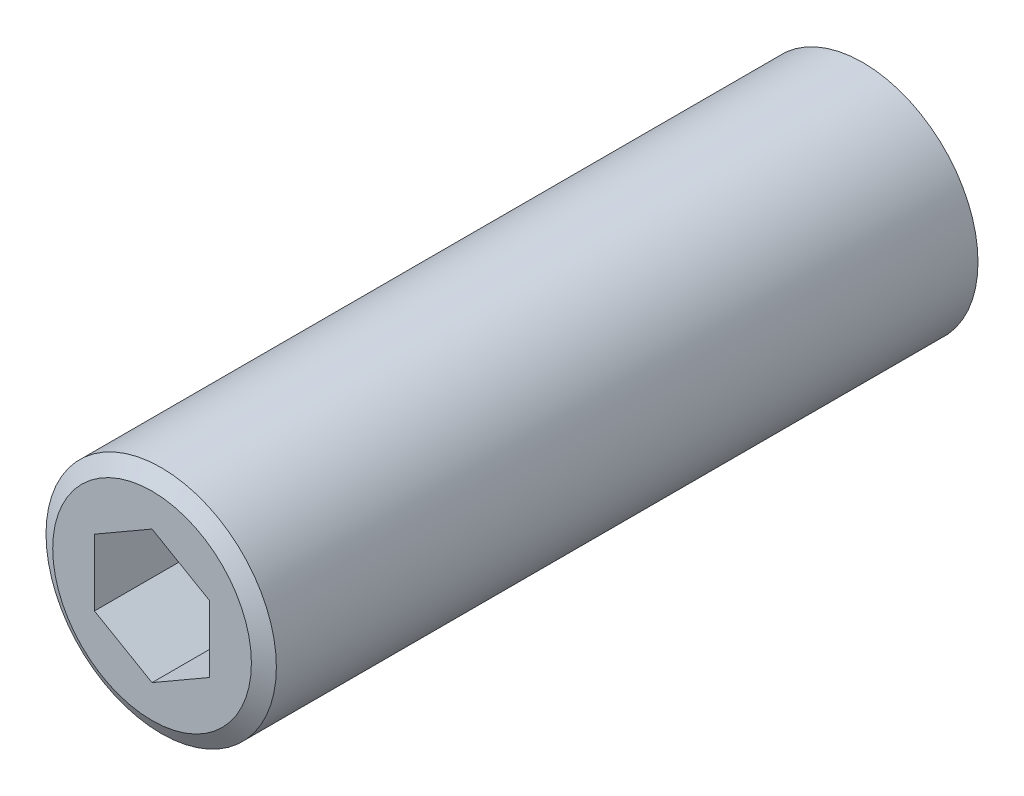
ISO-10303-21;
HEADER;
FILE_DESCRIPTION(('STEP AP214'),'2;1');
FILE_NAME('part.step','',(''),(''),'','','');
FILE_SCHEMA(('AUTOMOTIVE_DESIGN { 1 0 10303 214 1 1 1 1 }'));
ENDSEC;
DATA;
#1=APPLICATION_CONTEXT('core data for automotive mechanical design processes');
#2=APPLICATION_PROTOCOL_DEFINITION('international standard','automotive_design',2000,#1);
#3=PRODUCT_CONTEXT('',#1,'mechanical');
#4=PRODUCT('Part','Part','',(#3));
#5=PRODUCT_RELATED_PRODUCT_CATEGORY('part','',(#4));
#6=PRODUCT_DEFINITION_FORMATION('','',#4);
#7=PRODUCT_DEFINITION_CONTEXT('part definition',#1,'design');
#8=PRODUCT_DEFINITION('design','',#6,#7);
#9=PRODUCT_DEFINITION_SHAPE('','',#8);
#10=(LENGTH_UNIT() NAMED_UNIT(*) SI_UNIT(.MILLI.,.METRE.));
#11=(NAMED_UNIT(*) PLANE_ANGLE_UNIT() SI_UNIT($,.RADIAN.));
#12=(NAMED_UNIT(*) SI_UNIT($,.STERADIAN.) SOLID_ANGLE_UNIT());
#13=UNCERTAINTY_MEASURE_WITH_UNIT(LENGTH_MEASURE(1.E-05),#10,'distance_accuracy_value','');
#14=(GEOMETRIC_REPRESENTATION_CONTEXT(3) GLOBAL_UNCERTAINTY_ASSIGNED_CONTEXT((#13)) GLOBAL_UNIT_ASSIGNED_CONTEXT((#10,
#11,#12)) REPRESENTATION_CONTEXT('',''));
#15=CARTESIAN_POINT('',(0.,0.,0.));
#16=DIRECTION('',(0.,0.,1.));
#17=DIRECTION('',(1.,0.,0.));
#18=AXIS2_PLACEMENT_3D('',#15,#16,#17);
#19=CARTESIAN_POINT('',(8.,0.,1.27));
#20=DIRECTION('',(0.,0.,-1.));
#21=DIRECTION('',(-1.,0.,0.));
#22=AXIS2_PLACEMENT_3D('',#19,#20,#21);
#23=PLANE('',#22);
#24=CARTESIAN_POINT('',(0.,0.,1.27));
#25=DIRECTION('',(0.,0.,-1.));
#26=DIRECTION('',(-1.,0.,0.));
#27=AXIS2_PLACEMENT_3D('',#24,#25,#26);
#28=CIRCLE('',#27,6.9);
#29=CARTESIAN_POINT('',(-6.9,0.,1.27));
#30=VERTEX_POINT('',#29);
#31=EDGE_CURVE('E284',#30,#30,#28,.T.);
#32=ORIENTED_EDGE('',*,*,#31,.T.);
#33=EDGE_LOOP('',(#32));
#34=FACE_BOUND('',#33,.T.);
#35=CARTESIAN_POINT('',(0.,0.,1.27));
#36=DIRECTION('',(0.,0.,-1.));
#37=DIRECTION('',(-1.,0.,0.));
#38=AXIS2_PLACEMENT_3D('',#35,#36,#37);
#39=CIRCLE('',#38,5.55);
#40=CARTESIAN_POINT('',(-5.55,0.,1.27));
#41=VERTEX_POINT('',#40);
#42=EDGE_CURVE('E170',#41,#41,#39,.T.);
#43=ORIENTED_EDGE('',*,*,#42,.F.);
#44=EDGE_LOOP('',(#43));
#45=FACE_BOUND('',#44,.T.);
#46=ADVANCED_FACE('F15',(#34,#45),#23,.T.);
#47=CARTESIAN_POINT('',(0.,0.,46.27));
#48=DIRECTION('',(0.,0.,1.));
#49=DIRECTION('',(1.,0.,0.));
#50=AXIS2_PLACEMENT_3D('',#47,#48,#49);
#51=CYLINDRICAL_SURFACE('',#50,8.);
#52=CARTESIAN_POINT('',(0.,0.,50.6349147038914));
#53=DIRECTION('',(0.,0.,1.));
#54=DIRECTION('',(1.,0.,0.));
#55=AXIS2_PLACEMENT_3D('',#52,#53,#54);
#56=CIRCLE('',#55,8.);
#57=CARTESIAN_POINT('',(8.,0.,50.6349147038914));
#58=VERTEX_POINT('',#57);
#59=EDGE_CURVE('E9',#58,#58,#56,.F.);
#60=ORIENTED_EDGE('',*,*,#59,.T.);
#61=EDGE_LOOP('',(#60));
#62=FACE_BOUND('',#61,.T.);
#63=CARTESIAN_POINT('',(0.,0.,1.90508529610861));
#64=DIRECTION('',(0.,0.,-1.));
#65=DIRECTION('',(-1.,0.,0.));
#66=AXIS2_PLACEMENT_3D('',#63,#64,#65);
#67=CIRCLE('',#66,8.);
#68=CARTESIAN_POINT('',(-8.,0.,1.90508529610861));
#69=VERTEX_POINT('',#68);
#70=EDGE_CURVE('E280',#69,#69,#67,.F.);
#71=ORIENTED_EDGE('',*,*,#70,.T.);
#72=EDGE_LOOP('',(#71));
#73=FACE_BOUND('',#72,.T.);
#74=ADVANCED_FACE('F303',(#62,#73),#51,.T.);
#75=CARTESIAN_POINT('',(0.,0.,12.37));
#76=DIRECTION('',(0.,0.,-1.));
#77=DIRECTION('',(-1.,0.,0.));
#78=AXIS2_PLACEMENT_3D('',#75,#76,#77);
#79=CYLINDRICAL_SURFACE('',#78,5.55);
#80=ORIENTED_EDGE('',*,*,#42,.T.);
#81=EDGE_LOOP('',(#80));
#82=FACE_BOUND('',#81,.T.);
#83=CARTESIAN_POINT('',(0.,0.,1.5));
#84=DIRECTION('',(0.,0.,1.));
#85=DIRECTION('',(1.,0.,0.));
#86=AXIS2_PLACEMENT_3D('',#83,#84,#85);
#87=CIRCLE('',#86,5.55);
#88=CARTESIAN_POINT('',(5.55,0.,1.5));
#89=VERTEX_POINT('',#88);
#90=EDGE_CURVE('E185',#89,#89,#87,.T.);
#91=ORIENTED_EDGE('',*,*,#90,.T.);
#92=EDGE_LOOP('',(#91));
#93=FACE_BOUND('',#92,.T.);
#94=ADVANCED_FACE('F309',(#82,#93),#79,.F.);
#95=CARTESIAN_POINT('',(5.55,0.,1.5));
#96=DIRECTION('',(0.,-0.707106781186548,0.707106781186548));
#97=DIRECTION('',(0.,0.707106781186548,0.707106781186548));
#98=AXIS2_PLACEMENT_3D('',#95,#96,#97);
#99=PLANE('',#98);
#100=DIRECTION('',(-1.,0.,0.));
#101=VECTOR('',#100,1.);
#102=CARTESIAN_POINT('',(5.55,0.,1.5));
#103=LINE('',#102,#101);
#104=CARTESIAN_POINT('',(0.,0.,1.5));
#105=VERTEX_POINT('',#104);
#106=CARTESIAN_POINT('',(-3.,0.,1.5));
#107=VERTEX_POINT('',#106);
#108=EDGE_CURVE('E190',#105,#107,#103,.T.);
#109=ORIENTED_EDGE('',*,*,#108,.F.);
#110=DIRECTION('',(0.577350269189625,0.577350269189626,0.577350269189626));
#111=VECTOR('',#110,1.);
#112=CARTESIAN_POINT('',(-1.85,-1.85,-0.349999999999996));
#113=LINE('',#112,#111);
#114=CARTESIAN_POINT('',(-1.5,-1.5,0.));
#115=VERTEX_POINT('',#114);
#116=EDGE_CURVE('E230',#115,#105,#113,.T.);
#117=ORIENTED_EDGE('',*,*,#116,.F.);
#118=DIRECTION('',(0.577350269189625,-0.577350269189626,-0.577350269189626));
#119=VECTOR('',#118,1.);
#120=CARTESIAN_POINT('',(-0.150000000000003,-2.85,-1.35));
#121=LINE('',#120,#119);
#122=EDGE_CURVE('E234',#107,#115,#121,.T.);
#123=ORIENTED_EDGE('',*,*,#122,.F.);
#124=EDGE_LOOP('',(#109,#117,#123));
#125=FACE_BOUND('',#124,.T.);
#126=ADVANCED_FACE('F372',(#125),#99,.F.);
#127=CARTESIAN_POINT('',(5.55,1.49999999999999,0.));
#128=DIRECTION('',(0.,0.707106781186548,0.707106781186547));
#129=DIRECTION('',(0.,0.707106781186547,-0.707106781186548));
#130=AXIS2_PLACEMENT_3D('',#127,#128,#129);
#131=PLANE('',#130);
#132=DIRECTION('',(-0.577350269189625,0.577350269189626,-0.577350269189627));
#133=VECTOR('',#132,1.);
#134=CARTESIAN_POINT('',(1.85,-1.85,3.35));
#135=LINE('',#134,#133);
#136=CARTESIAN_POINT('',(-1.5,1.49999999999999,0.));
#137=VERTEX_POINT('',#136);
#138=EDGE_CURVE('E241',#105,#137,#135,.T.);
#139=ORIENTED_EDGE('',*,*,#138,.F.);
#140=ORIENTED_EDGE('',*,*,#108,.T.);
#141=DIRECTION('',(-0.577350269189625,-0.577350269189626,0.577350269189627));
#142=VECTOR('',#141,1.);
#143=CARTESIAN_POINT('',(-3.85,-0.850000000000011,2.35));
#144=LINE('',#143,#142);
#145=EDGE_CURVE('E245',#137,#107,#144,.T.);
#146=ORIENTED_EDGE('',*,*,#145,.F.);
#147=EDGE_LOOP('',(#139,#140,#146));
#148=FACE_BOUND('',#147,.T.);
#149=ADVANCED_FACE('F359',(#148),#131,.F.);
#150=CARTESIAN_POINT('',(0.,-5.55,1.5));
#151=DIRECTION('',(-0.707106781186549,0.,0.707106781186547));
#152=DIRECTION('',(0.707106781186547,0.,0.707106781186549));
#153=AXIS2_PLACEMENT_3D('',#150,#151,#152);
#154=PLANE('',#153);
#155=DIRECTION('',(0.,1.,0.));
#156=VECTOR('',#155,1.);
#157=CARTESIAN_POINT('',(0.,-5.55,1.5));
#158=LINE('',#157,#156);
#159=CARTESIAN_POINT('',(0.,3.,1.5));
#160=VERTEX_POINT('',#159);
#161=EDGE_CURVE('E250',#105,#160,#158,.T.);
#162=ORIENTED_EDGE('',*,*,#161,.F.);
#163=ORIENTED_EDGE('',*,*,#138,.T.);
#164=DIRECTION('',(0.577350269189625,0.577350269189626,0.577350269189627));
#165=VECTOR('',#164,1.);
#166=CARTESIAN_POINT('',(-2.85,0.15,-1.35));
#167=LINE('',#166,#165);
#168=EDGE_CURVE('E206',#137,#160,#167,.T.);
#169=ORIENTED_EDGE('',*,*,#168,.T.);
#170=EDGE_LOOP('',(#162,#163,#169));
#171=FACE_BOUND('',#170,.T.);
#172=ADVANCED_FACE('F350',(#171),#154,.F.);
#173=CARTESIAN_POINT('',(1.5,-5.55,0.));
#174=DIRECTION('',(0.707106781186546,0.,0.707106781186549));
#175=DIRECTION('',(0.707106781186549,0.,-0.707106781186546));
#176=AXIS2_PLACEMENT_3D('',#173,#174,#175);
#177=PLANE('',#176);
#178=DIRECTION('',(0.577350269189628,-0.577350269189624,-0.577350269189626));
#179=VECTOR('',#178,1.);
#180=CARTESIAN_POINT('',(3.85,-0.849999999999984,-2.35));
#181=LINE('',#180,#179);
#182=CARTESIAN_POINT('',(1.49999999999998,1.49999999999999,0.));
#183=VERTEX_POINT('',#182);
#184=EDGE_CURVE('E202',#160,#183,#181,.T.);
#185=ORIENTED_EDGE('',*,*,#184,.T.);
#186=DIRECTION('',(-0.577350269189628,-0.577350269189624,0.577350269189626));
#187=VECTOR('',#186,1.);
#188=CARTESIAN_POINT('',(-0.849999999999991,-0.85,2.35));
#189=LINE('',#188,#187);
#190=EDGE_CURVE('E237',#183,#105,#189,.T.);
#191=ORIENTED_EDGE('',*,*,#190,.T.);
#192=ORIENTED_EDGE('',*,*,#161,.T.);
#193=EDGE_LOOP('',(#185,#191,#192));
#194=FACE_BOUND('',#193,.T.);
#195=ADVANCED_FACE('F347',(#194),#177,.F.);
#196=DIRECTION('',(-0.577350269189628,0.577350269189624,-0.577350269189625));
#197=VECTOR('',#196,1.);
#198=CARTESIAN_POINT('',(3.85,-0.85,2.35));
#199=LINE('',#198,#197);
#200=CARTESIAN_POINT('',(3.,0.,1.5));
#201=VERTEX_POINT('',#200);
#202=EDGE_CURVE('E268',#201,#183,#199,.T.);
#203=ORIENTED_EDGE('',*,*,#202,.F.);
#204=EDGE_CURVE('E39',#201,#105,#103,.T.);
#205=ORIENTED_EDGE('',*,*,#204,.T.);
#206=ORIENTED_EDGE('',*,*,#190,.F.);
#207=EDGE_LOOP('',(#203,#205,#206));
#208=FACE_BOUND('',#207,.T.);
#209=ADVANCED_FACE('F349',(#208),#131,.F.);
#210=ORIENTED_EDGE('',*,*,#204,.F.);
#211=DIRECTION('',(0.577350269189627,0.577350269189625,0.577350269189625));
#212=VECTOR('',#211,1.);
#213=CARTESIAN_POINT('',(0.149999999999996,-2.85,-1.35));
#214=LINE('',#213,#212);
#215=CARTESIAN_POINT('',(1.5,-1.5,0.));
#216=VERTEX_POINT('',#215);
#217=EDGE_CURVE('E272',#216,#201,#214,.T.);
#218=ORIENTED_EDGE('',*,*,#217,.F.);
#219=DIRECTION('',(0.577350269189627,-0.577350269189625,-0.577350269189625));
#220=VECTOR('',#219,1.);
#221=CARTESIAN_POINT('',(2.85,-2.85,-1.35));
#222=LINE('',#221,#220);
#223=EDGE_CURVE('E226',#105,#216,#222,.T.);
#224=ORIENTED_EDGE('',*,*,#223,.F.);
#225=EDGE_LOOP('',(#210,#218,#224));
#226=FACE_BOUND('',#225,.T.);
#227=ADVANCED_FACE('F357',(#226),#99,.F.);
#228=ORIENTED_EDGE('',*,*,#223,.T.);
#229=DIRECTION('',(-0.577350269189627,-0.577350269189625,0.577350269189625));
#230=VECTOR('',#229,1.);
#231=CARTESIAN_POINT('',(0.15,-2.85,1.35));
#232=LINE('',#231,#230);
#233=CARTESIAN_POINT('',(0.,-3.00000000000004,1.5));
#234=VERTEX_POINT('',#233);
#235=EDGE_CURVE('E214',#216,#234,#232,.T.);
#236=ORIENTED_EDGE('',*,*,#235,.T.);
#237=EDGE_CURVE('E254',#234,#105,#158,.T.);
#238=ORIENTED_EDGE('',*,*,#237,.T.);
#239=EDGE_LOOP('',(#228,#236,#238));
#240=FACE_BOUND('',#239,.T.);
#241=ADVANCED_FACE('F352',(#240),#177,.F.);
#242=ORIENTED_EDGE('',*,*,#237,.F.);
#243=DIRECTION('',(-0.577350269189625,0.577350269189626,-0.577350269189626));
#244=VECTOR('',#243,1.);
#245=CARTESIAN_POINT('',(0.85,-3.85,2.35));
#246=LINE('',#245,#244);
#247=EDGE_CURVE('E218',#234,#115,#246,.T.);
#248=ORIENTED_EDGE('',*,*,#247,.T.);
#249=ORIENTED_EDGE('',*,*,#116,.T.);
#250=EDGE_LOOP('',(#242,#248,#249));
#251=FACE_BOUND('',#250,.T.);
#252=ADVANCED_FACE('F361',(#251),#154,.F.);
#253=CARTESIAN_POINT('',(-1.5,-5.55,0.));
#254=DIRECTION('',(0.707106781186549,0.,0.707106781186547));
#255=DIRECTION('',(0.707106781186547,0.,-0.707106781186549));
#256=AXIS2_PLACEMENT_3D('',#253,#254,#255);
#257=PLANE('',#256);
#258=ORIENTED_EDGE('',*,*,#122,.T.);
#259=DIRECTION('',(-0.577350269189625,-0.577350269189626,0.577350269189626));
#260=VECTOR('',#259,1.);
#261=CARTESIAN_POINT('',(-2.85,-2.85,1.35));
#262=LINE('',#261,#260);
#263=CARTESIAN_POINT('',(-3.,-3.00000000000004,1.5));
#264=VERTEX_POINT('',#263);
#265=EDGE_CURVE('E222',#115,#264,#262,.T.);
#266=ORIENTED_EDGE('',*,*,#265,.T.);
#267=DIRECTION('',(0.,1.,0.));
#268=VECTOR('',#267,1.);
#269=CARTESIAN_POINT('',(-3.,-5.55,1.5));
#270=LINE('',#269,#268);
#271=EDGE_CURVE('E255',#264,#107,#270,.T.);
#272=ORIENTED_EDGE('',*,*,#271,.T.);
#273=EDGE_LOOP('',(#258,#266,#272));
#274=FACE_BOUND('',#273,.T.);
#275=ADVANCED_FACE('F368',(#274),#257,.F.);
#276=DIRECTION('',(0.577350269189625,-0.577350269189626,-0.577350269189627));
#277=VECTOR('',#276,1.);
#278=CARTESIAN_POINT('',(0.85,-0.85,-2.35));
#279=LINE('',#278,#277);
#280=CARTESIAN_POINT('',(-3.,2.99999999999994,1.5));
#281=VERTEX_POINT('',#280);
#282=EDGE_CURVE('E210',#281,#137,#279,.T.);
#283=ORIENTED_EDGE('',*,*,#282,.T.);
#284=ORIENTED_EDGE('',*,*,#145,.T.);
#285=EDGE_CURVE('E256',#107,#281,#270,.T.);
#286=ORIENTED_EDGE('',*,*,#285,.T.);
#287=EDGE_LOOP('',(#283,#284,#286));
#288=FACE_BOUND('',#287,.T.);
#289=ADVANCED_FACE('F340',(#288),#257,.F.);
#290=CARTESIAN_POINT('',(5.55,1.49999999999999,0.));
#291=DIRECTION('',(0.,-0.707106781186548,0.707106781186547));
#292=DIRECTION('',(0.,0.707106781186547,0.707106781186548));
#293=AXIS2_PLACEMENT_3D('',#290,#291,#292);
#294=PLANE('',#293);
#295=DIRECTION('',(-1.,0.,0.));
#296=VECTOR('',#295,1.);
#297=CARTESIAN_POINT('',(5.55,2.99999999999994,1.5));
#298=LINE('',#297,#296);
#299=EDGE_CURVE('E189',#160,#281,#298,.T.);
#300=ORIENTED_EDGE('',*,*,#299,.F.);
#301=ORIENTED_EDGE('',*,*,#168,.F.);
#302=ORIENTED_EDGE('',*,*,#282,.F.);
#303=EDGE_LOOP('',(#300,#301,#302));
#304=FACE_BOUND('',#303,.T.);
#305=ADVANCED_FACE('F387',(#304),#294,.F.);
#306=CARTESIAN_POINT('',(3.,3.,1.5));
#307=VERTEX_POINT('',#306);
#308=EDGE_CURVE('E198',#307,#160,#298,.T.);
#309=ORIENTED_EDGE('',*,*,#308,.F.);
#310=DIRECTION('',(0.577350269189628,0.577350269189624,0.577350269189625));
#311=VECTOR('',#310,1.);
#312=CARTESIAN_POINT('',(-0.85,-0.849999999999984,-2.35));
#313=LINE('',#312,#311);
#314=EDGE_CURVE('E264',#183,#307,#313,.T.);
#315=ORIENTED_EDGE('',*,*,#314,.F.);
#316=ORIENTED_EDGE('',*,*,#184,.F.);
#317=EDGE_LOOP('',(#309,#315,#316));
#318=FACE_BOUND('',#317,.T.);
#319=ADVANCED_FACE('F345',(#318),#294,.F.);
#320=CARTESIAN_POINT('',(1.5,-5.55,0.));
#321=DIRECTION('',(-0.707106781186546,0.,0.707106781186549));
#322=DIRECTION('',(0.707106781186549,0.,0.707106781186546));
#323=AXIS2_PLACEMENT_3D('',#320,#321,#322);
#324=PLANE('',#323);
#325=DIRECTION('',(0.,1.,0.));
#326=VECTOR('',#325,1.);
#327=CARTESIAN_POINT('',(3.,-5.55,1.5));
#328=LINE('',#327,#326);
#329=EDGE_CURVE('E249',#201,#307,#328,.T.);
#330=ORIENTED_EDGE('',*,*,#329,.F.);
#331=ORIENTED_EDGE('',*,*,#202,.T.);
#332=ORIENTED_EDGE('',*,*,#314,.T.);
#333=EDGE_LOOP('',(#330,#331,#332));
#334=FACE_BOUND('',#333,.T.);
#335=ADVANCED_FACE('F342',(#334),#324,.F.);
#336=CARTESIAN_POINT('',(3.,-3.00000000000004,1.5));
#337=VERTEX_POINT('',#336);
#338=EDGE_CURVE('E260',#337,#201,#328,.T.);
#339=ORIENTED_EDGE('',*,*,#338,.F.);
#340=DIRECTION('',(-0.577350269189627,0.577350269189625,-0.577350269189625));
#341=VECTOR('',#340,1.);
#342=CARTESIAN_POINT('',(2.85,-2.85,1.35));
#343=LINE('',#342,#341);
#344=EDGE_CURVE('E276',#337,#216,#343,.T.);
#345=ORIENTED_EDGE('',*,*,#344,.T.);
#346=ORIENTED_EDGE('',*,*,#217,.T.);
#347=EDGE_LOOP('',(#339,#345,#346));
#348=FACE_BOUND('',#347,.T.);
#349=ADVANCED_FACE('F344',(#348),#324,.F.);
#350=CARTESIAN_POINT('',(5.55,-1.5,0.));
#351=DIRECTION('',(0.,0.707106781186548,0.707106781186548));
#352=DIRECTION('',(0.,0.707106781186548,-0.707106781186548));
#353=AXIS2_PLACEMENT_3D('',#350,#351,#352);
#354=PLANE('',#353);
#355=ORIENTED_EDGE('',*,*,#344,.F.);
#356=DIRECTION('',(-1.,0.,0.));
#357=VECTOR('',#356,1.);
#358=CARTESIAN_POINT('',(5.55,-3.00000000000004,1.5));
#359=LINE('',#358,#357);
#360=EDGE_CURVE('E194',#337,#234,#359,.T.);
#361=ORIENTED_EDGE('',*,*,#360,.T.);
#362=ORIENTED_EDGE('',*,*,#235,.F.);
#363=EDGE_LOOP('',(#355,#361,#362));
#364=FACE_BOUND('',#363,.T.);
#365=ADVANCED_FACE('F333',(#364),#354,.F.);
#366=ORIENTED_EDGE('',*,*,#247,.F.);
#367=EDGE_CURVE('E195',#234,#264,#359,.T.);
#368=ORIENTED_EDGE('',*,*,#367,.T.);
#369=ORIENTED_EDGE('',*,*,#265,.F.);
#370=EDGE_LOOP('',(#366,#368,#369));
#371=FACE_BOUND('',#370,.T.);
#372=ADVANCED_FACE('F323',(#371),#354,.F.);
#373=CARTESIAN_POINT('',(-3.,-5.55,1.5));
#374=DIRECTION('',(0.,0.,1.));
#375=DIRECTION('',(1.,0.,0.));
#376=AXIS2_PLACEMENT_3D('',#373,#374,#375);
#377=PLANE('',#376);
#378=ORIENTED_EDGE('',*,*,#367,.F.);
#379=ORIENTED_EDGE('',*,*,#360,.F.);
#380=ORIENTED_EDGE('',*,*,#338,.T.);
#381=ORIENTED_EDGE('',*,*,#329,.T.);
#382=ORIENTED_EDGE('',*,*,#308,.T.);
#383=ORIENTED_EDGE('',*,*,#299,.T.);
#384=ORIENTED_EDGE('',*,*,#285,.F.);
#385=ORIENTED_EDGE('',*,*,#271,.F.);
#386=EDGE_LOOP('',(#378,#379,#380,#381,#382,#383,#384,#385));
#387=FACE_BOUND('',#386,.T.);
#388=ORIENTED_EDGE('',*,*,#90,.F.);
#389=EDGE_LOOP('',(#388));
#390=FACE_BOUND('',#389,.T.);
#391=ADVANCED_FACE('F316',(#387,#390),#377,.F.);
#392=CARTESIAN_POINT('',(0.,0.,1.90508529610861));
#393=DIRECTION('',(0.,0.,1.));
#394=DIRECTION('',(1.,0.,0.));
#395=AXIS2_PLACEMENT_3D('',#392,#393,#394);
#396=CONICAL_SURFACE('',#395,8.,1.0471975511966);
#397=ORIENTED_EDGE('',*,*,#31,.F.);
#398=EDGE_LOOP('',(#397));
#399=FACE_BOUND('',#398,.T.);
#400=ORIENTED_EDGE('',*,*,#70,.F.);
#401=EDGE_LOOP('',(#400));
#402=FACE_BOUND('',#401,.T.);
#403=ADVANCED_FACE('F314',(#399,#402),#396,.T.);
#404=CARTESIAN_POINT('',(0.,0.,51.27));
#405=DIRECTION('',(0.,0.,1.));
#406=DIRECTION('',(1.,0.,0.));
#407=AXIS2_PLACEMENT_3D('',#404,#405,#406);
#408=PLANE('',#407);
#409=CARTESIAN_POINT('',(0.,0.,51.27));
#410=DIRECTION('',(0.,0.,1.));
#411=DIRECTION('',(1.,0.,0.));
#412=AXIS2_PLACEMENT_3D('',#409,#410,#411);
#413=CIRCLE('',#412,6.9);
#414=CARTESIAN_POINT('',(6.9,0.,51.27));
#415=VERTEX_POINT('',#414);
#416=EDGE_CURVE('E24',#415,#415,#413,.T.);
#417=ORIENTED_EDGE('',*,*,#416,.T.);
#418=EDGE_LOOP('',(#417));
#419=FACE_BOUND('',#418,.T.);
#420=DIRECTION('',(-0.866025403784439,0.5,0.));
#421=VECTOR('',#420,1.);
#422=CARTESIAN_POINT('',(4.,2.30940107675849,51.27));
#423=LINE('',#422,#421);
#424=CARTESIAN_POINT('',(4.,2.30940107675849,51.27));
#425=VERTEX_POINT('',#424);
#426=CARTESIAN_POINT('',(0.,4.618802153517,51.27));
#427=VERTEX_POINT('',#426);
#428=EDGE_CURVE('E31',#425,#427,#423,.T.);
#429=ORIENTED_EDGE('',*,*,#428,.F.);
#430=DIRECTION('',(0.,1.,0.));
#431=VECTOR('',#430,1.);
#432=CARTESIAN_POINT('',(4.,-2.30940107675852,51.27));
#433=LINE('',#432,#431);
#434=CARTESIAN_POINT('',(4.,-2.30940107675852,51.27));
#435=VERTEX_POINT('',#434);
#436=EDGE_CURVE('E132',#435,#425,#433,.T.);
#437=ORIENTED_EDGE('',*,*,#436,.F.);
#438=DIRECTION('',(0.866025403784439,0.5,0.));
#439=VECTOR('',#438,1.);
#440=CARTESIAN_POINT('',(0.,-4.61880215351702,51.27));
#441=LINE('',#440,#439);
#442=CARTESIAN_POINT('',(0.,-4.61880215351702,51.27));
#443=VERTEX_POINT('',#442);
#444=EDGE_CURVE('E137',#443,#435,#441,.T.);
#445=ORIENTED_EDGE('',*,*,#444,.F.);
#446=DIRECTION('',(0.866025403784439,-0.5,0.));
#447=VECTOR('',#446,1.);
#448=CARTESIAN_POINT('',(-4.,-2.30940107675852,51.27));
#449=LINE('',#448,#447);
#450=CARTESIAN_POINT('',(-4.,-2.30940107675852,51.27));
#451=VERTEX_POINT('',#450);
#452=EDGE_CURVE('E160',#451,#443,#449,.T.);
#453=ORIENTED_EDGE('',*,*,#452,.F.);
#454=DIRECTION('',(0.,-1.,0.));
#455=VECTOR('',#454,1.);
#456=CARTESIAN_POINT('',(-4.,2.30940107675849,51.27));
#457=LINE('',#456,#455);
#458=CARTESIAN_POINT('',(-4.,2.30940107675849,51.27));
#459=VERTEX_POINT('',#458);
#460=EDGE_CURVE('E156',#459,#451,#457,.T.);
#461=ORIENTED_EDGE('',*,*,#460,.F.);
#462=DIRECTION('',(-0.866025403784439,-0.5,0.));
#463=VECTOR('',#462,1.);
#464=CARTESIAN_POINT('',(0.,4.618802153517,51.27));
#465=LINE('',#464,#463);
#466=EDGE_CURVE('E153',#427,#459,#465,.T.);
#467=ORIENTED_EDGE('',*,*,#466,.F.);
#468=EDGE_LOOP('',(#429,#437,#445,#453,#461,#467));
#469=FACE_BOUND('',#468,.T.);
#470=ADVANCED_FACE('F291',(#419,#469),#408,.T.);
#471=CARTESIAN_POINT('',(4.,2.30940107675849,45.27));
#472=DIRECTION('',(0.5,0.866025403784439,0.));
#473=DIRECTION('',(0.866025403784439,-0.5,0.));
#474=AXIS2_PLACEMENT_3D('',#471,#472,#473);
#475=PLANE('',#474);
#476=ORIENTED_EDGE('',*,*,#428,.T.);
#477=DIRECTION('',(0.,0.,1.));
#478=VECTOR('',#477,1.);
#479=CARTESIAN_POINT('',(0.,4.618802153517,45.27));
#480=LINE('',#479,#478);
#481=CARTESIAN_POINT('',(0.,4.618802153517,45.27));
#482=VERTEX_POINT('',#481);
#483=EDGE_CURVE('E106',#482,#427,#480,.T.);
#484=ORIENTED_EDGE('',*,*,#483,.F.);
#485=DIRECTION('',(-0.866025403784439,0.5,0.));
#486=VECTOR('',#485,1.);
#487=CARTESIAN_POINT('',(4.,2.30940107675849,45.27));
#488=LINE('',#487,#486);
#489=CARTESIAN_POINT('',(4.,2.30940107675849,45.27));
#490=VERTEX_POINT('',#489);
#491=EDGE_CURVE('E110',#490,#482,#488,.T.);
#492=ORIENTED_EDGE('',*,*,#491,.F.);
#493=DIRECTION('',(0.,0.,1.));
#494=VECTOR('',#493,1.);
#495=CARTESIAN_POINT('',(4.,2.30940107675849,45.27));
#496=LINE('',#495,#494);
#497=EDGE_CURVE('E167',#490,#425,#496,.T.);
#498=ORIENTED_EDGE('',*,*,#497,.T.);
#499=EDGE_LOOP('',(#476,#484,#492,#498));
#500=FACE_BOUND('',#499,.T.);
#501=ADVANCED_FACE('F108',(#500),#475,.F.);
#502=CARTESIAN_POINT('',(4.,-2.30940107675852,45.27));
#503=DIRECTION('',(1.,0.,0.));
#504=DIRECTION('',(0.,0.,-1.));
#505=AXIS2_PLACEMENT_3D('',#502,#503,#504);
#506=PLANE('',#505);
#507=ORIENTED_EDGE('',*,*,#436,.T.);
#508=ORIENTED_EDGE('',*,*,#497,.F.);
#509=DIRECTION('',(0.,1.,0.));
#510=VECTOR('',#509,1.);
#511=CARTESIAN_POINT('',(4.,-2.30940107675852,45.27));
#512=LINE('',#511,#510);
#513=CARTESIAN_POINT('',(4.,-2.30940107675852,45.27));
#514=VERTEX_POINT('',#513);
#515=EDGE_CURVE('E117',#514,#490,#512,.T.);
#516=ORIENTED_EDGE('',*,*,#515,.F.);
#517=DIRECTION('',(0.,0.,1.));
#518=VECTOR('',#517,1.);
#519=CARTESIAN_POINT('',(4.,-2.30940107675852,45.27));
#520=LINE('',#519,#518);
#521=EDGE_CURVE('E171',#514,#435,#520,.T.);
#522=ORIENTED_EDGE('',*,*,#521,.T.);
#523=EDGE_LOOP('',(#507,#508,#516,#522));
#524=FACE_BOUND('',#523,.T.);
#525=ADVANCED_FACE('F427',(#524),#506,.F.);
#526=CARTESIAN_POINT('',(0.,-4.61880215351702,45.27));
#527=DIRECTION('',(0.5,-0.866025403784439,0.));
#528=DIRECTION('',(-0.866025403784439,-0.5,0.));
#529=AXIS2_PLACEMENT_3D('',#526,#527,#528);
#530=PLANE('',#529);
#531=ORIENTED_EDGE('',*,*,#444,.T.);
#532=ORIENTED_EDGE('',*,*,#521,.F.);
#533=DIRECTION('',(0.866025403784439,0.5,0.));
#534=VECTOR('',#533,1.);
#535=CARTESIAN_POINT('',(0.,-4.61880215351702,45.27));
#536=LINE('',#535,#534);
#537=CARTESIAN_POINT('',(0.,-4.61880215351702,45.27));
#538=VERTEX_POINT('',#537);
#539=EDGE_CURVE('E146',#538,#514,#536,.T.);
#540=ORIENTED_EDGE('',*,*,#539,.F.);
#541=DIRECTION('',(0.,0.,1.));
#542=VECTOR('',#541,1.);
#543=CARTESIAN_POINT('',(0.,-4.61880215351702,45.27));
#544=LINE('',#543,#542);
#545=EDGE_CURVE('E174',#538,#443,#544,.T.);
#546=ORIENTED_EDGE('',*,*,#545,.T.);
#547=EDGE_LOOP('',(#531,#532,#540,#546));
#548=FACE_BOUND('',#547,.T.);
#549=ADVANCED_FACE('F437',(#548),#530,.F.);
#550=CARTESIAN_POINT('',(-4.,-2.30940107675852,45.27));
#551=DIRECTION('',(-0.5,-0.866025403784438,0.));
#552=DIRECTION('',(-0.866025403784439,0.5,0.));
#553=AXIS2_PLACEMENT_3D('',#550,#551,#552);
#554=PLANE('',#553);
#555=ORIENTED_EDGE('',*,*,#452,.T.);
#556=ORIENTED_EDGE('',*,*,#545,.F.);
#557=DIRECTION('',(0.866025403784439,-0.5,0.));
#558=VECTOR('',#557,1.);
#559=CARTESIAN_POINT('',(-4.,-2.30940107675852,45.27));
#560=LINE('',#559,#558);
#561=CARTESIAN_POINT('',(-4.,-2.30940107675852,45.27));
#562=VERTEX_POINT('',#561);
#563=EDGE_CURVE('E142',#562,#538,#560,.T.);
#564=ORIENTED_EDGE('',*,*,#563,.F.);
#565=DIRECTION('',(0.,0.,1.));
#566=VECTOR('',#565,1.);
#567=CARTESIAN_POINT('',(-4.,-2.30940107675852,45.27));
#568=LINE('',#567,#566);
#569=EDGE_CURVE('E177',#562,#451,#568,.T.);
#570=ORIENTED_EDGE('',*,*,#569,.T.);
#571=EDGE_LOOP('',(#555,#556,#564,#570));
#572=FACE_BOUND('',#571,.T.);
#573=ADVANCED_FACE('F433',(#572),#554,.F.);
#574=CARTESIAN_POINT('',(-4.,2.30940107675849,45.27));
#575=DIRECTION('',(-1.,0.,0.));
#576=DIRECTION('',(0.,1.,0.));
#577=AXIS2_PLACEMENT_3D('',#574,#575,#576);
#578=PLANE('',#577);
#579=ORIENTED_EDGE('',*,*,#460,.T.);
#580=ORIENTED_EDGE('',*,*,#569,.F.);
#581=DIRECTION('',(0.,-1.,0.));
#582=VECTOR('',#581,1.);
#583=CARTESIAN_POINT('',(-4.,2.30940107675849,45.27));
#584=LINE('',#583,#582);
#585=CARTESIAN_POINT('',(-4.,2.30940107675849,45.27));
#586=VERTEX_POINT('',#585);
#587=EDGE_CURVE('E126',#586,#562,#584,.T.);
#588=ORIENTED_EDGE('',*,*,#587,.F.);
#589=DIRECTION('',(0.,0.,1.));
#590=VECTOR('',#589,1.);
#591=CARTESIAN_POINT('',(-4.,2.30940107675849,45.27));
#592=LINE('',#591,#590);
#593=EDGE_CURVE('E116',#586,#459,#592,.T.);
#594=ORIENTED_EDGE('',*,*,#593,.T.);
#595=EDGE_LOOP('',(#579,#580,#588,#594));
#596=FACE_BOUND('',#595,.T.);
#597=ADVANCED_FACE('F430',(#596),#578,.F.);
#598=CARTESIAN_POINT('',(0.,4.618802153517,45.27));
#599=DIRECTION('',(-0.5,0.866025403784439,0.));
#600=DIRECTION('',(0.866025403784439,0.5,0.));
#601=AXIS2_PLACEMENT_3D('',#598,#599,#600);
#602=PLANE('',#601);
#603=ORIENTED_EDGE('',*,*,#466,.T.);
#604=ORIENTED_EDGE('',*,*,#593,.F.);
#605=DIRECTION('',(-0.866025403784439,-0.5,0.));
#606=VECTOR('',#605,1.);
#607=CARTESIAN_POINT('',(0.,4.618802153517,45.27));
#608=LINE('',#607,#606);
#609=EDGE_CURVE('E120',#482,#586,#608,.T.);
#610=ORIENTED_EDGE('',*,*,#609,.F.);
#611=ORIENTED_EDGE('',*,*,#483,.T.);
#612=EDGE_LOOP('',(#603,#604,#610,#611));
#613=FACE_BOUND('',#612,.T.);
#614=ADVANCED_FACE('F121',(#613),#602,.F.);
#615=CARTESIAN_POINT('',(0.,4.618802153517,45.27));
#616=DIRECTION('',(0.,0.,1.));
#617=DIRECTION('',(1.,0.,0.));
#618=AXIS2_PLACEMENT_3D('',#615,#616,#617);
#619=PLANE('',#618);
#620=ORIENTED_EDGE('',*,*,#491,.T.);
#621=ORIENTED_EDGE('',*,*,#609,.T.);
#622=ORIENTED_EDGE('',*,*,#587,.T.);
#623=ORIENTED_EDGE('',*,*,#563,.T.);
#624=ORIENTED_EDGE('',*,*,#539,.T.);
#625=ORIENTED_EDGE('',*,*,#515,.T.);
#626=EDGE_LOOP('',(#620,#621,#622,#623,#624,#625));
#627=FACE_BOUND('',#626,.T.);
#628=ADVANCED_FACE('F128',(#627),#619,.T.);
#629=CARTESIAN_POINT('',(0.,0.,51.27));
#630=DIRECTION('',(0.,0.,-1.));
#631=DIRECTION('',(-1.,0.,0.));
#632=AXIS2_PLACEMENT_3D('',#629,#630,#631);
#633=CONICAL_SURFACE('',#632,6.9,1.0471975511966);
#634=ORIENTED_EDGE('',*,*,#59,.F.);
#635=EDGE_LOOP('',(#634));
#636=FACE_BOUND('',#635,.T.);
#637=ORIENTED_EDGE('',*,*,#416,.F.);
#638=EDGE_LOOP('',(#637));
#639=FACE_BOUND('',#638,.T.);
#640=ADVANCED_FACE('F17',(#636,#639),#633,.T.);
#641=CLOSED_SHELL('',(#46,#74,#94,#126,#149,#172,#195,#209,#227,#241,#252,#275,#289,#305,#319,
#335,#349,#365,#372,#391,#403,#470,#501,#525,#549,#573,#597,#614,#628,#640));
#642=MANIFOLD_SOLID_BREP('B1',#641);
#643=ADVANCED_BREP_SHAPE_REPRESENTATION('',(#18,#642),#14);
#644=SHAPE_DEFINITION_REPRESENTATION(#9,#643);
ENDSEC;
END-ISO-10303-21;
